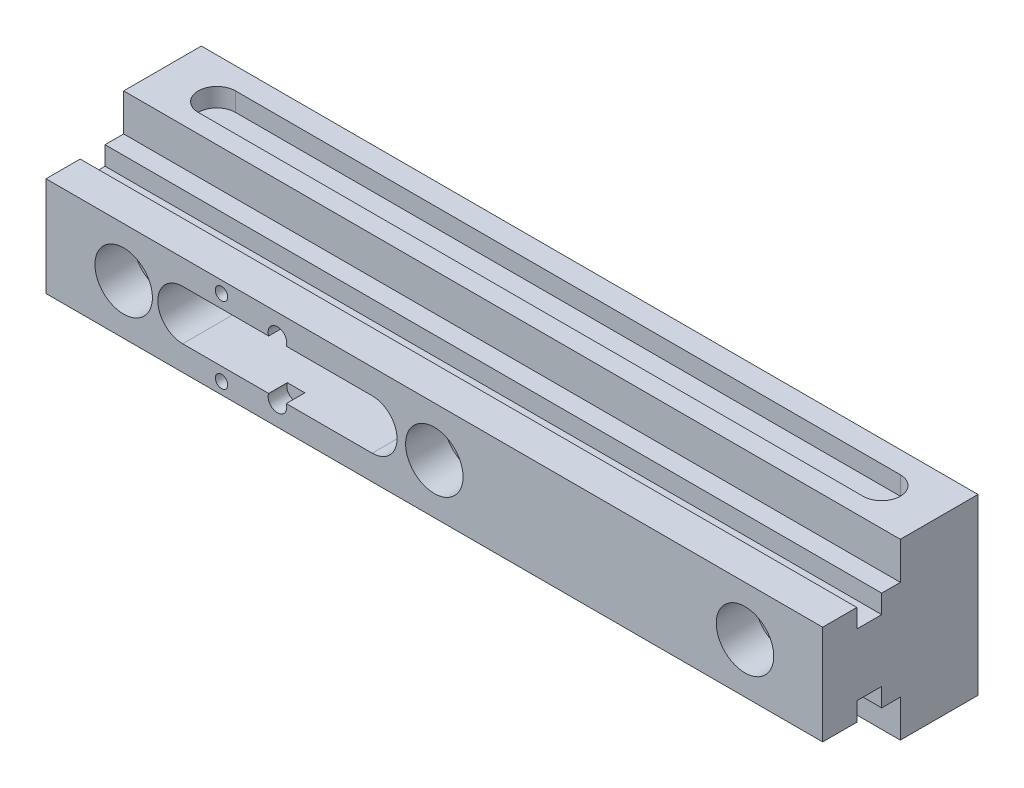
ISO-10303-21;
HEADER;
FILE_DESCRIPTION(('STEP AP214'),'2;1');
FILE_NAME('part.step','',(''),(''),'','','');
FILE_SCHEMA(('AUTOMOTIVE_DESIGN { 1 0 10303 214 1 1 1 1 }'));
ENDSEC;
DATA;
#1=APPLICATION_CONTEXT('core data for automotive mechanical design processes');
#2=APPLICATION_PROTOCOL_DEFINITION('international standard','automotive_design',2000,#1);
#3=PRODUCT_CONTEXT('',#1,'mechanical');
#4=PRODUCT('Part','Part','',(#3));
#5=PRODUCT_RELATED_PRODUCT_CATEGORY('part','',(#4));
#6=PRODUCT_DEFINITION_FORMATION('','',#4);
#7=PRODUCT_DEFINITION_CONTEXT('part definition',#1,'design');
#8=PRODUCT_DEFINITION('design','',#6,#7);
#9=PRODUCT_DEFINITION_SHAPE('','',#8);
#10=(LENGTH_UNIT() NAMED_UNIT(*) SI_UNIT(.MILLI.,.METRE.));
#11=(NAMED_UNIT(*) PLANE_ANGLE_UNIT() SI_UNIT($,.RADIAN.));
#12=(NAMED_UNIT(*) SI_UNIT($,.STERADIAN.) SOLID_ANGLE_UNIT());
#13=UNCERTAINTY_MEASURE_WITH_UNIT(LENGTH_MEASURE(1.E-05),#10,'distance_accuracy_value','');
#14=(GEOMETRIC_REPRESENTATION_CONTEXT(3) GLOBAL_UNCERTAINTY_ASSIGNED_CONTEXT((#13)) GLOBAL_UNIT_ASSIGNED_CONTEXT((#10,
#11,#12)) REPRESENTATION_CONTEXT('',''));
#15=CARTESIAN_POINT('',(0.,0.,0.));
#16=DIRECTION('',(0.,0.,1.));
#17=DIRECTION('',(1.,0.,0.));
#18=AXIS2_PLACEMENT_3D('',#15,#16,#17);
#19=CARTESIAN_POINT('',(0.,22.,13.));
#20=DIRECTION('',(0.,-1.,0.));
#21=DIRECTION('',(0.,0.,-1.));
#22=AXIS2_PLACEMENT_3D('',#19,#20,#21);
#23=PLANE('',#22);
#24=CARTESIAN_POINT('',(-107.,22.,13.));
#25=DIRECTION('',(0.,1.,0.));
#26=DIRECTION('',(0.,0.,1.));
#27=AXIS2_PLACEMENT_3D('',#24,#25,#26);
#28=CIRCLE('',#27,6.);
#29=CARTESIAN_POINT('',(-107.,22.,7.));
#30=VERTEX_POINT('',#29);
#31=CARTESIAN_POINT('',(-107.,22.,19.));
#32=VERTEX_POINT('',#31);
#33=EDGE_CURVE('E440',#30,#32,#28,.T.);
#34=ORIENTED_EDGE('',*,*,#33,.T.);
#35=DIRECTION('',(1.,0.,0.));
#36=VECTOR('',#35,1.);
#37=CARTESIAN_POINT('',(-107.,22.,19.));
#38=LINE('',#37,#36);
#39=CARTESIAN_POINT('',(107.,22.,19.));
#40=VERTEX_POINT('',#39);
#41=EDGE_CURVE('E436',#40,#32,#38,.F.);
#42=ORIENTED_EDGE('',*,*,#41,.F.);
#43=CARTESIAN_POINT('',(107.,22.,13.));
#44=DIRECTION('',(0.,1.,0.));
#45=DIRECTION('',(0.,0.,1.));
#46=AXIS2_PLACEMENT_3D('',#43,#44,#45);
#47=CIRCLE('',#46,6.);
#48=CARTESIAN_POINT('',(107.,22.,7.));
#49=VERTEX_POINT('',#48);
#50=EDGE_CURVE('E429',#40,#49,#47,.T.);
#51=ORIENTED_EDGE('',*,*,#50,.T.);
#52=DIRECTION('',(1.,0.,0.));
#53=VECTOR('',#52,1.);
#54=CARTESIAN_POINT('',(107.,22.,7.));
#55=LINE('',#54,#53);
#56=EDGE_CURVE('E257',#30,#49,#55,.T.);
#57=ORIENTED_EDGE('',*,*,#56,.F.);
#58=EDGE_LOOP('',(#34,#42,#51,#57));
#59=FACE_BOUND('',#58,.T.);
#60=ADVANCED_FACE('F14',(#59),#23,.F.);
#61=CARTESIAN_POINT('',(0.,-22.,13.));
#62=DIRECTION('',(0.,-1.,0.));
#63=DIRECTION('',(0.,0.,-1.));
#64=AXIS2_PLACEMENT_3D('',#61,#62,#63);
#65=PLANE('',#64);
#66=DIRECTION('',(-1.,0.,0.));
#67=VECTOR('',#66,1.);
#68=CARTESIAN_POINT('',(-107.,-22.,19.));
#69=LINE('',#68,#67);
#70=CARTESIAN_POINT('',(107.,-22.,19.));
#71=VERTEX_POINT('',#70);
#72=CARTESIAN_POINT('',(-107.,-22.,19.));
#73=VERTEX_POINT('',#72);
#74=EDGE_CURVE('E396',#71,#73,#69,.T.);
#75=ORIENTED_EDGE('',*,*,#74,.T.);
#76=CARTESIAN_POINT('',(-107.,-22.,13.));
#77=DIRECTION('',(0.,1.,0.));
#78=DIRECTION('',(0.,0.,1.));
#79=AXIS2_PLACEMENT_3D('',#76,#77,#78);
#80=CIRCLE('',#79,6.);
#81=CARTESIAN_POINT('',(-107.,-22.,7.));
#82=VERTEX_POINT('',#81);
#83=EDGE_CURVE('E402',#73,#82,#80,.F.);
#84=ORIENTED_EDGE('',*,*,#83,.T.);
#85=DIRECTION('',(1.,0.,0.));
#86=VECTOR('',#85,1.);
#87=CARTESIAN_POINT('',(107.,-22.,7.));
#88=LINE('',#87,#86);
#89=CARTESIAN_POINT('',(107.,-22.,7.));
#90=VERTEX_POINT('',#89);
#91=EDGE_CURVE('E405',#82,#90,#88,.T.);
#92=ORIENTED_EDGE('',*,*,#91,.T.);
#93=CARTESIAN_POINT('',(107.,-22.,13.));
#94=DIRECTION('',(0.,1.,0.));
#95=DIRECTION('',(0.,0.,1.));
#96=AXIS2_PLACEMENT_3D('',#93,#94,#95);
#97=CIRCLE('',#96,6.);
#98=EDGE_CURVE('E408',#90,#71,#97,.F.);
#99=ORIENTED_EDGE('',*,*,#98,.T.);
#100=EDGE_LOOP('',(#75,#84,#92,#99));
#101=FACE_BOUND('',#100,.T.);
#102=ADVANCED_FACE('F952',(#101),#65,.T.);
#103=CARTESIAN_POINT('',(-100.,0.,43.75));
#104=DIRECTION('',(0.,0.,1.));
#105=DIRECTION('',(0.,-1.,0.));
#106=AXIS2_PLACEMENT_3D('',#103,#104,#105);
#107=CYLINDRICAL_SURFACE('',#106,9.25);
#108=CARTESIAN_POINT('',(-100.,0.,50.));
#109=DIRECTION('',(0.,0.,1.));
#110=DIRECTION('',(0.,-1.,0.));
#111=AXIS2_PLACEMENT_3D('',#108,#109,#110);
#112=CIRCLE('',#111,9.25);
#113=CARTESIAN_POINT('',(-100.,-9.24999999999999,50.));
#114=VERTEX_POINT('',#113);
#115=EDGE_CURVE('E475',#114,#114,#112,.F.);
#116=ORIENTED_EDGE('',*,*,#115,.F.);
#117=EDGE_LOOP('',(#116));
#118=FACE_BOUND('',#117,.T.);
#119=CARTESIAN_POINT('',(-100.,0.,37.5));
#120=DIRECTION('',(0.,0.,1.));
#121=DIRECTION('',(0.,-1.,0.));
#122=AXIS2_PLACEMENT_3D('',#119,#120,#121);
#123=CIRCLE('',#122,9.25);
#124=CARTESIAN_POINT('',(-100.,-9.24999999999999,37.5));
#125=VERTEX_POINT('',#124);
#126=EDGE_CURVE('E392',#125,#125,#123,.T.);
#127=ORIENTED_EDGE('',*,*,#126,.F.);
#128=EDGE_LOOP('',(#127));
#129=FACE_BOUND('',#128,.T.);
#130=ADVANCED_FACE('F942',(#118,#129),#107,.F.);
#131=CARTESIAN_POINT('',(100.,0.,43.75));
#132=DIRECTION('',(0.,0.,1.));
#133=DIRECTION('',(0.,-1.,0.));
#134=AXIS2_PLACEMENT_3D('',#131,#132,#133);
#135=CYLINDRICAL_SURFACE('',#134,9.25);
#136=CARTESIAN_POINT('',(100.,0.,50.));
#137=DIRECTION('',(0.,0.,1.));
#138=DIRECTION('',(0.,-1.,0.));
#139=AXIS2_PLACEMENT_3D('',#136,#137,#138);
#140=CIRCLE('',#139,9.25);
#141=CARTESIAN_POINT('',(100.,-9.24999999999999,50.));
#142=VERTEX_POINT('',#141);
#143=EDGE_CURVE('E472',#142,#142,#140,.F.);
#144=ORIENTED_EDGE('',*,*,#143,.F.);
#145=EDGE_LOOP('',(#144));
#146=FACE_BOUND('',#145,.T.);
#147=CARTESIAN_POINT('',(100.,0.,37.5));
#148=DIRECTION('',(0.,0.,1.));
#149=DIRECTION('',(0.,-1.,0.));
#150=AXIS2_PLACEMENT_3D('',#147,#148,#149);
#151=CIRCLE('',#150,9.25);
#152=CARTESIAN_POINT('',(100.,-9.24999999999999,37.5));
#153=VERTEX_POINT('',#152);
#154=EDGE_CURVE('E395',#153,#153,#151,.T.);
#155=ORIENTED_EDGE('',*,*,#154,.F.);
#156=EDGE_LOOP('',(#155));
#157=FACE_BOUND('',#156,.T.);
#158=ADVANCED_FACE('F932',(#146,#157),#135,.F.);
#159=CARTESIAN_POINT('',(0.,0.,43.75));
#160=DIRECTION('',(0.,0.,1.));
#161=DIRECTION('',(0.,-1.,0.));
#162=AXIS2_PLACEMENT_3D('',#159,#160,#161);
#163=CYLINDRICAL_SURFACE('',#162,9.25);
#164=CARTESIAN_POINT('',(0.,0.,37.5));
#165=DIRECTION('',(0.,0.,1.));
#166=DIRECTION('',(0.,-1.,0.));
#167=AXIS2_PLACEMENT_3D('',#164,#165,#166);
#168=CIRCLE('',#167,9.25);
#169=CARTESIAN_POINT('',(0.,-9.25,37.5));
#170=VERTEX_POINT('',#169);
#171=EDGE_CURVE('E386',#170,#170,#168,.T.);
#172=ORIENTED_EDGE('',*,*,#171,.F.);
#173=EDGE_LOOP('',(#172));
#174=FACE_BOUND('',#173,.T.);
#175=CARTESIAN_POINT('',(0.,0.,50.));
#176=DIRECTION('',(0.,0.,1.));
#177=DIRECTION('',(0.,-1.,0.));
#178=AXIS2_PLACEMENT_3D('',#175,#176,#177);
#179=CIRCLE('',#178,9.25);
#180=CARTESIAN_POINT('',(0.,-9.25,50.));
#181=VERTEX_POINT('',#180);
#182=EDGE_CURVE('E389',#181,#181,#179,.F.);
#183=ORIENTED_EDGE('',*,*,#182,.F.);
#184=EDGE_LOOP('',(#183));
#185=FACE_BOUND('',#184,.T.);
#186=ADVANCED_FACE('F922',(#174,#185),#163,.F.);
#187=CARTESIAN_POINT('',(107.,28.,7.));
#188=DIRECTION('',(0.,0.,1.));
#189=DIRECTION('',(0.,-1.,0.));
#190=AXIS2_PLACEMENT_3D('',#187,#188,#189);
#191=PLANE('',#190);
#192=ORIENTED_EDGE('',*,*,#56,.T.);
#193=DIRECTION('',(0.,1.,0.));
#194=VECTOR('',#193,1.);
#195=CARTESIAN_POINT('',(107.,28.,7.));
#196=LINE('',#195,#194);
#197=CARTESIAN_POINT('',(107.,28.,7.));
#198=VERTEX_POINT('',#197);
#199=EDGE_CURVE('E427',#49,#198,#196,.T.);
#200=ORIENTED_EDGE('',*,*,#199,.T.);
#201=DIRECTION('',(1.,0.,0.));
#202=VECTOR('',#201,1.);
#203=CARTESIAN_POINT('',(-125.,28.,7.));
#204=LINE('',#203,#202);
#205=CARTESIAN_POINT('',(-107.,28.,7.));
#206=VERTEX_POINT('',#205);
#207=EDGE_CURVE('E341',#198,#206,#204,.F.);
#208=ORIENTED_EDGE('',*,*,#207,.T.);
#209=DIRECTION('',(0.,1.,0.));
#210=VECTOR('',#209,1.);
#211=CARTESIAN_POINT('',(-107.,28.,7.));
#212=LINE('',#211,#210);
#213=EDGE_CURVE('E437',#206,#30,#212,.F.);
#214=ORIENTED_EDGE('',*,*,#213,.T.);
#215=EDGE_LOOP('',(#192,#200,#208,#214));
#216=FACE_BOUND('',#215,.T.);
#217=ADVANCED_FACE('F912',(#216),#191,.T.);
#218=CARTESIAN_POINT('',(-107.,28.,13.));
#219=DIRECTION('',(0.,1.,0.));
#220=DIRECTION('',(0.,0.,1.));
#221=AXIS2_PLACEMENT_3D('',#218,#219,#220);
#222=CYLINDRICAL_SURFACE('',#221,6.);
#223=DIRECTION('',(0.,1.,0.));
#224=VECTOR('',#223,1.);
#225=CARTESIAN_POINT('',(-107.,28.,19.));
#226=LINE('',#225,#224);
#227=CARTESIAN_POINT('',(-107.,28.,19.));
#228=VERTEX_POINT('',#227);
#229=EDGE_CURVE('E433',#32,#228,#226,.T.);
#230=ORIENTED_EDGE('',*,*,#229,.F.);
#231=ORIENTED_EDGE('',*,*,#33,.F.);
#232=ORIENTED_EDGE('',*,*,#213,.F.);
#233=CARTESIAN_POINT('',(-107.,28.,13.));
#234=DIRECTION('',(0.,1.,0.));
#235=DIRECTION('',(0.,0.,1.));
#236=AXIS2_PLACEMENT_3D('',#233,#234,#235);
#237=CIRCLE('',#236,6.);
#238=EDGE_CURVE('E340',#206,#228,#237,.T.);
#239=ORIENTED_EDGE('',*,*,#238,.T.);
#240=EDGE_LOOP('',(#230,#231,#232,#239));
#241=FACE_BOUND('',#240,.T.);
#242=ADVANCED_FACE('F902',(#241),#222,.F.);
#243=CARTESIAN_POINT('',(-107.,28.,19.));
#244=DIRECTION('',(0.,0.,-1.));
#245=DIRECTION('',(0.,1.,0.));
#246=AXIS2_PLACEMENT_3D('',#243,#244,#245);
#247=PLANE('',#246);
#248=ORIENTED_EDGE('',*,*,#41,.T.);
#249=ORIENTED_EDGE('',*,*,#229,.T.);
#250=DIRECTION('',(1.,0.,0.));
#251=VECTOR('',#250,1.);
#252=CARTESIAN_POINT('',(-125.,28.,19.));
#253=LINE('',#252,#251);
#254=CARTESIAN_POINT('',(107.,28.,19.));
#255=VERTEX_POINT('',#254);
#256=EDGE_CURVE('E338',#228,#255,#253,.T.);
#257=ORIENTED_EDGE('',*,*,#256,.T.);
#258=DIRECTION('',(0.,1.,0.));
#259=VECTOR('',#258,1.);
#260=CARTESIAN_POINT('',(107.,28.,19.));
#261=LINE('',#260,#259);
#262=EDGE_CURVE('E430',#255,#40,#261,.F.);
#263=ORIENTED_EDGE('',*,*,#262,.T.);
#264=EDGE_LOOP('',(#248,#249,#257,#263));
#265=FACE_BOUND('',#264,.T.);
#266=ADVANCED_FACE('F892',(#265),#247,.T.);
#267=CARTESIAN_POINT('',(107.,28.,13.));
#268=DIRECTION('',(0.,1.,0.));
#269=DIRECTION('',(0.,0.,1.));
#270=AXIS2_PLACEMENT_3D('',#267,#268,#269);
#271=CYLINDRICAL_SURFACE('',#270,6.);
#272=ORIENTED_EDGE('',*,*,#199,.F.);
#273=ORIENTED_EDGE('',*,*,#50,.F.);
#274=ORIENTED_EDGE('',*,*,#262,.F.);
#275=CARTESIAN_POINT('',(107.,28.,13.));
#276=DIRECTION('',(0.,1.,0.));
#277=DIRECTION('',(0.,0.,1.));
#278=AXIS2_PLACEMENT_3D('',#275,#276,#277);
#279=CIRCLE('',#278,6.);
#280=EDGE_CURVE('E337',#255,#198,#279,.T.);
#281=ORIENTED_EDGE('',*,*,#280,.T.);
#282=EDGE_LOOP('',(#272,#273,#274,#281));
#283=FACE_BOUND('',#282,.T.);
#284=ADVANCED_FACE('F883',(#283),#271,.F.);
#285=CARTESIAN_POINT('',(-125.,16.,25.));
#286=DIRECTION('',(0.,0.,-1.));
#287=DIRECTION('',(0.,1.,0.));
#288=AXIS2_PLACEMENT_3D('',#285,#286,#287);
#289=PLANE('',#288);
#290=DIRECTION('',(1.,0.,0.));
#291=VECTOR('',#290,1.);
#292=CARTESIAN_POINT('',(-125.,16.,25.));
#293=LINE('',#292,#291);
#294=CARTESIAN_POINT('',(-125.,16.,25.));
#295=VERTEX_POINT('',#294);
#296=CARTESIAN_POINT('',(125.,16.,25.));
#297=VERTEX_POINT('',#296);
#298=EDGE_CURVE('E425',#295,#297,#293,.T.);
#299=ORIENTED_EDGE('',*,*,#298,.T.);
#300=DIRECTION('',(0.,-1.,0.));
#301=VECTOR('',#300,1.);
#302=CARTESIAN_POINT('',(125.,-11.8571428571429,25.));
#303=LINE('',#302,#301);
#304=CARTESIAN_POINT('',(125.,28.,25.));
#305=VERTEX_POINT('',#304);
#306=EDGE_CURVE('E331',#305,#297,#303,.T.);
#307=ORIENTED_EDGE('',*,*,#306,.F.);
#308=DIRECTION('',(1.,0.,0.));
#309=VECTOR('',#308,1.);
#310=CARTESIAN_POINT('',(-125.,28.,25.));
#311=LINE('',#310,#309);
#312=CARTESIAN_POINT('',(-125.,28.,25.));
#313=VERTEX_POINT('',#312);
#314=EDGE_CURVE('E345',#305,#313,#311,.F.);
#315=ORIENTED_EDGE('',*,*,#314,.T.);
#316=DIRECTION('',(0.,-1.,0.));
#317=VECTOR('',#316,1.);
#318=CARTESIAN_POINT('',(-125.,-11.8571428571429,25.));
#319=LINE('',#318,#317);
#320=EDGE_CURVE('E347',#295,#313,#319,.F.);
#321=ORIENTED_EDGE('',*,*,#320,.F.);
#322=EDGE_LOOP('',(#299,#307,#315,#321));
#323=FACE_BOUND('',#322,.T.);
#324=ADVANCED_FACE('F617',(#323),#289,.F.);
#325=CARTESIAN_POINT('',(-125.,16.,31.));
#326=DIRECTION('',(0.,-1.,0.));
#327=DIRECTION('',(0.,0.,-1.));
#328=AXIS2_PLACEMENT_3D('',#325,#326,#327);
#329=PLANE('',#328);
#330=DIRECTION('',(1.,0.,0.));
#331=VECTOR('',#330,1.);
#332=CARTESIAN_POINT('',(-125.,16.,31.));
#333=LINE('',#332,#331);
#334=CARTESIAN_POINT('',(-125.,16.,31.));
#335=VERTEX_POINT('',#334);
#336=CARTESIAN_POINT('',(125.,16.,31.));
#337=VERTEX_POINT('',#336);
#338=EDGE_CURVE('E423',#335,#337,#333,.T.);
#339=ORIENTED_EDGE('',*,*,#338,.T.);
#340=DIRECTION('',(0.,0.,1.));
#341=VECTOR('',#340,1.);
#342=CARTESIAN_POINT('',(125.,16.,23.9285714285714));
#343=LINE('',#342,#341);
#344=EDGE_CURVE('E328',#297,#337,#343,.T.);
#345=ORIENTED_EDGE('',*,*,#344,.F.);
#346=ORIENTED_EDGE('',*,*,#298,.F.);
#347=DIRECTION('',(0.,0.,-1.));
#348=VECTOR('',#347,1.);
#349=CARTESIAN_POINT('',(-125.,16.,23.9285714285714));
#350=LINE('',#349,#348);
#351=EDGE_CURVE('E350',#335,#295,#350,.T.);
#352=ORIENTED_EDGE('',*,*,#351,.F.);
#353=EDGE_LOOP('',(#339,#345,#346,#352));
#354=FACE_BOUND('',#353,.T.);
#355=ADVANCED_FACE('F621',(#354),#329,.F.);
#356=CARTESIAN_POINT('',(-125.,10.,31.));
#357=DIRECTION('',(0.,0.,-1.));
#358=DIRECTION('',(0.,1.,0.));
#359=AXIS2_PLACEMENT_3D('',#356,#357,#358);
#360=PLANE('',#359);
#361=DIRECTION('',(1.,0.,0.));
#362=VECTOR('',#361,1.);
#363=CARTESIAN_POINT('',(-125.,10.,31.));
#364=LINE('',#363,#362);
#365=CARTESIAN_POINT('',(-125.,10.,31.));
#366=VERTEX_POINT('',#365);
#367=CARTESIAN_POINT('',(125.,10.,31.));
#368=VERTEX_POINT('',#367);
#369=EDGE_CURVE('E421',#366,#368,#364,.T.);
#370=ORIENTED_EDGE('',*,*,#369,.T.);
#371=DIRECTION('',(0.,-1.,0.));
#372=VECTOR('',#371,1.);
#373=CARTESIAN_POINT('',(125.,-11.8571428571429,31.));
#374=LINE('',#373,#372);
#375=EDGE_CURVE('E325',#337,#368,#374,.T.);
#376=ORIENTED_EDGE('',*,*,#375,.F.);
#377=ORIENTED_EDGE('',*,*,#338,.F.);
#378=DIRECTION('',(0.,-1.,0.));
#379=VECTOR('',#378,1.);
#380=CARTESIAN_POINT('',(-125.,-11.8571428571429,31.));
#381=LINE('',#380,#379);
#382=EDGE_CURVE('E353',#366,#335,#381,.F.);
#383=ORIENTED_EDGE('',*,*,#382,.F.);
#384=EDGE_LOOP('',(#370,#376,#377,#383));
#385=FACE_BOUND('',#384,.T.);
#386=ADVANCED_FACE('F623',(#385),#360,.F.);
#387=CARTESIAN_POINT('',(-125.,10.,39.));
#388=DIRECTION('',(0.,-1.,0.));
#389=DIRECTION('',(0.,0.,-1.));
#390=AXIS2_PLACEMENT_3D('',#387,#388,#389);
#391=PLANE('',#390);
#392=DIRECTION('',(1.,0.,0.));
#393=VECTOR('',#392,1.);
#394=CARTESIAN_POINT('',(-125.,10.,39.));
#395=LINE('',#394,#393);
#396=CARTESIAN_POINT('',(-125.,10.,39.));
#397=VERTEX_POINT('',#396);
#398=CARTESIAN_POINT('',(125.,10.,39.));
#399=VERTEX_POINT('',#398);
#400=EDGE_CURVE('E419',#397,#399,#395,.T.);
#401=ORIENTED_EDGE('',*,*,#400,.T.);
#402=DIRECTION('',(0.,0.,1.));
#403=VECTOR('',#402,1.);
#404=CARTESIAN_POINT('',(125.,10.,23.9285714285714));
#405=LINE('',#404,#403);
#406=EDGE_CURVE('E322',#368,#399,#405,.T.);
#407=ORIENTED_EDGE('',*,*,#406,.F.);
#408=ORIENTED_EDGE('',*,*,#369,.F.);
#409=DIRECTION('',(0.,0.,-1.));
#410=VECTOR('',#409,1.);
#411=CARTESIAN_POINT('',(-125.,10.,23.9285714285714));
#412=LINE('',#411,#410);
#413=EDGE_CURVE('E356',#397,#366,#412,.T.);
#414=ORIENTED_EDGE('',*,*,#413,.F.);
#415=EDGE_LOOP('',(#401,#407,#408,#414));
#416=FACE_BOUND('',#415,.T.);
#417=ADVANCED_FACE('F561',(#416),#391,.F.);
#418=CARTESIAN_POINT('',(-125.,16.,39.));
#419=DIRECTION('',(0.,0.,1.));
#420=DIRECTION('',(0.,-1.,0.));
#421=AXIS2_PLACEMENT_3D('',#418,#419,#420);
#422=PLANE('',#421);
#423=CARTESIAN_POINT('',(-68.5,12.25,39.));
#424=DIRECTION('',(0.,0.,1.));
#425=DIRECTION('',(0.,-1.,0.));
#426=AXIS2_PLACEMENT_3D('',#423,#424,#425);
#427=CIRCLE('',#426,2.);
#428=CARTESIAN_POINT('',(-68.5,10.25,39.));
#429=VERTEX_POINT('',#428);
#430=EDGE_CURVE('E229',#429,#429,#427,.T.);
#431=ORIENTED_EDGE('',*,*,#430,.T.);
#432=EDGE_LOOP('',(#431));
#433=FACE_BOUND('',#432,.T.);
#434=DIRECTION('',(1.,0.,0.));
#435=VECTOR('',#434,1.);
#436=CARTESIAN_POINT('',(-125.,16.,39.));
#437=LINE('',#436,#435);
#438=CARTESIAN_POINT('',(-125.,16.,39.));
#439=VERTEX_POINT('',#438);
#440=CARTESIAN_POINT('',(125.,16.,39.));
#441=VERTEX_POINT('',#440);
#442=EDGE_CURVE('E417',#439,#441,#437,.T.);
#443=ORIENTED_EDGE('',*,*,#442,.T.);
#444=DIRECTION('',(0.,-1.,0.));
#445=VECTOR('',#444,1.);
#446=CARTESIAN_POINT('',(125.,-11.8571428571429,39.));
#447=LINE('',#446,#445);
#448=EDGE_CURVE('E319',#399,#441,#447,.F.);
#449=ORIENTED_EDGE('',*,*,#448,.F.);
#450=ORIENTED_EDGE('',*,*,#400,.F.);
#451=DIRECTION('',(0.,-1.,0.));
#452=VECTOR('',#451,1.);
#453=CARTESIAN_POINT('',(-125.,-11.8571428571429,39.));
#454=LINE('',#453,#452);
#455=EDGE_CURVE('E359',#439,#397,#454,.T.);
#456=ORIENTED_EDGE('',*,*,#455,.F.);
#457=EDGE_LOOP('',(#443,#449,#450,#456));
#458=FACE_BOUND('',#457,.T.);
#459=ADVANCED_FACE('F557',(#433,#458),#422,.F.);
#460=CARTESIAN_POINT('',(-125.,16.,50.));
#461=DIRECTION('',(0.,-1.,0.));
#462=DIRECTION('',(0.,0.,-1.));
#463=AXIS2_PLACEMENT_3D('',#460,#461,#462);
#464=PLANE('',#463);
#465=DIRECTION('',(1.,0.,0.));
#466=VECTOR('',#465,1.);
#467=CARTESIAN_POINT('',(-125.,16.,50.));
#468=LINE('',#467,#466);
#469=CARTESIAN_POINT('',(125.,16.,50.));
#470=VERTEX_POINT('',#469);
#471=CARTESIAN_POINT('',(-125.,16.,50.));
#472=VERTEX_POINT('',#471);
#473=EDGE_CURVE('E387',#470,#472,#468,.F.);
#474=ORIENTED_EDGE('',*,*,#473,.F.);
#475=DIRECTION('',(0.,0.,1.));
#476=VECTOR('',#475,1.);
#477=CARTESIAN_POINT('',(125.,16.,23.9285714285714));
#478=LINE('',#477,#476);
#479=EDGE_CURVE('E316',#441,#470,#478,.T.);
#480=ORIENTED_EDGE('',*,*,#479,.F.);
#481=ORIENTED_EDGE('',*,*,#442,.F.);
#482=DIRECTION('',(0.,0.,-1.));
#483=VECTOR('',#482,1.);
#484=CARTESIAN_POINT('',(-125.,16.,23.9285714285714));
#485=LINE('',#484,#483);
#486=EDGE_CURVE('E362',#472,#439,#485,.T.);
#487=ORIENTED_EDGE('',*,*,#486,.F.);
#488=EDGE_LOOP('',(#474,#480,#481,#487));
#489=FACE_BOUND('',#488,.T.);
#490=ADVANCED_FACE('F560',(#489),#464,.F.);
#491=CARTESIAN_POINT('',(-125.,-16.,50.));
#492=DIRECTION('',(0.,-1.,0.));
#493=DIRECTION('',(0.,0.,-1.));
#494=AXIS2_PLACEMENT_3D('',#491,#492,#493);
#495=PLANE('',#494);
#496=DIRECTION('',(0.,0.,1.));
#497=VECTOR('',#496,1.);
#498=CARTESIAN_POINT('',(125.,-16.,23.9285714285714));
#499=LINE('',#498,#497);
#500=CARTESIAN_POINT('',(125.,-16.,50.));
#501=VERTEX_POINT('',#500);
#502=CARTESIAN_POINT('',(125.,-16.,39.));
#503=VERTEX_POINT('',#502);
#504=EDGE_CURVE('E310',#501,#503,#499,.F.);
#505=ORIENTED_EDGE('',*,*,#504,.F.);
#506=DIRECTION('',(1.,0.,0.));
#507=VECTOR('',#506,1.);
#508=CARTESIAN_POINT('',(-125.,-16.,50.));
#509=LINE('',#508,#507);
#510=CARTESIAN_POINT('',(-125.,-16.,50.));
#511=VERTEX_POINT('',#510);
#512=EDGE_CURVE('E390',#511,#501,#509,.T.);
#513=ORIENTED_EDGE('',*,*,#512,.F.);
#514=DIRECTION('',(0.,0.,-1.));
#515=VECTOR('',#514,1.);
#516=CARTESIAN_POINT('',(-125.,-16.,23.9285714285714));
#517=LINE('',#516,#515);
#518=CARTESIAN_POINT('',(-125.,-16.,39.));
#519=VERTEX_POINT('',#518);
#520=EDGE_CURVE('E368',#519,#511,#517,.F.);
#521=ORIENTED_EDGE('',*,*,#520,.F.);
#522=DIRECTION('',(1.,0.,0.));
#523=VECTOR('',#522,1.);
#524=CARTESIAN_POINT('',(-125.,-16.,39.));
#525=LINE('',#524,#523);
#526=EDGE_CURVE('E415',#503,#519,#525,.F.);
#527=ORIENTED_EDGE('',*,*,#526,.F.);
#528=EDGE_LOOP('',(#505,#513,#521,#527));
#529=FACE_BOUND('',#528,.T.);
#530=ADVANCED_FACE('F584',(#529),#495,.T.);
#531=CARTESIAN_POINT('',(-125.,-16.,39.));
#532=DIRECTION('',(0.,0.,-1.));
#533=DIRECTION('',(0.,1.,0.));
#534=AXIS2_PLACEMENT_3D('',#531,#532,#533);
#535=PLANE('',#534);
#536=CARTESIAN_POINT('',(-68.5,-12.25,39.));
#537=DIRECTION('',(0.,0.,-1.));
#538=DIRECTION('',(-1.,0.,0.));
#539=AXIS2_PLACEMENT_3D('',#536,#537,#538);
#540=CIRCLE('',#539,2.);
#541=CARTESIAN_POINT('',(-70.5,-12.25,39.));
#542=VERTEX_POINT('',#541);
#543=EDGE_CURVE('E534',#542,#542,#540,.T.);
#544=ORIENTED_EDGE('',*,*,#543,.F.);
#545=EDGE_LOOP('',(#544));
#546=FACE_BOUND('',#545,.T.);
#547=DIRECTION('',(0.,-1.,0.));
#548=VECTOR('',#547,1.);
#549=CARTESIAN_POINT('',(125.,-11.8571428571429,39.));
#550=LINE('',#549,#548);
#551=CARTESIAN_POINT('',(125.,-10.,39.));
#552=VERTEX_POINT('',#551);
#553=EDGE_CURVE('E307',#503,#552,#550,.F.);
#554=ORIENTED_EDGE('',*,*,#553,.F.);
#555=ORIENTED_EDGE('',*,*,#526,.T.);
#556=DIRECTION('',(0.,-1.,0.));
#557=VECTOR('',#556,1.);
#558=CARTESIAN_POINT('',(-125.,-11.8571428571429,39.));
#559=LINE('',#558,#557);
#560=CARTESIAN_POINT('',(-125.,-10.,39.));
#561=VERTEX_POINT('',#560);
#562=EDGE_CURVE('E371',#561,#519,#559,.T.);
#563=ORIENTED_EDGE('',*,*,#562,.F.);
#564=DIRECTION('',(1.,0.,0.));
#565=VECTOR('',#564,1.);
#566=CARTESIAN_POINT('',(-125.,-10.,39.));
#567=LINE('',#566,#565);
#568=EDGE_CURVE('E413',#552,#561,#567,.F.);
#569=ORIENTED_EDGE('',*,*,#568,.F.);
#570=EDGE_LOOP('',(#554,#555,#563,#569));
#571=FACE_BOUND('',#570,.T.);
#572=ADVANCED_FACE('F587',(#546,#571),#535,.T.);
#573=CARTESIAN_POINT('',(-125.,-10.,39.));
#574=DIRECTION('',(0.,-1.,0.));
#575=DIRECTION('',(0.,0.,-1.));
#576=AXIS2_PLACEMENT_3D('',#573,#574,#575);
#577=PLANE('',#576);
#578=DIRECTION('',(0.,0.,1.));
#579=VECTOR('',#578,1.);
#580=CARTESIAN_POINT('',(125.,-10.,23.9285714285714));
#581=LINE('',#580,#579);
#582=CARTESIAN_POINT('',(125.,-10.,31.));
#583=VERTEX_POINT('',#582);
#584=EDGE_CURVE('E304',#552,#583,#581,.F.);
#585=ORIENTED_EDGE('',*,*,#584,.F.);
#586=ORIENTED_EDGE('',*,*,#568,.T.);
#587=DIRECTION('',(0.,0.,-1.));
#588=VECTOR('',#587,1.);
#589=CARTESIAN_POINT('',(-125.,-10.,23.9285714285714));
#590=LINE('',#589,#588);
#591=CARTESIAN_POINT('',(-125.,-10.,31.));
#592=VERTEX_POINT('',#591);
#593=EDGE_CURVE('E374',#592,#561,#590,.F.);
#594=ORIENTED_EDGE('',*,*,#593,.F.);
#595=DIRECTION('',(1.,0.,0.));
#596=VECTOR('',#595,1.);
#597=CARTESIAN_POINT('',(-125.,-10.,31.));
#598=LINE('',#597,#596);
#599=EDGE_CURVE('E411',#583,#592,#598,.F.);
#600=ORIENTED_EDGE('',*,*,#599,.F.);
#601=EDGE_LOOP('',(#585,#586,#594,#600));
#602=FACE_BOUND('',#601,.T.);
#603=ADVANCED_FACE('F591',(#602),#577,.T.);
#604=CARTESIAN_POINT('',(-125.,-10.,31.));
#605=DIRECTION('',(0.,0.,1.));
#606=DIRECTION('',(0.,-1.,0.));
#607=AXIS2_PLACEMENT_3D('',#604,#605,#606);
#608=PLANE('',#607);
#609=DIRECTION('',(0.,-1.,0.));
#610=VECTOR('',#609,1.);
#611=CARTESIAN_POINT('',(125.,-11.8571428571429,31.));
#612=LINE('',#611,#610);
#613=CARTESIAN_POINT('',(125.,-16.,31.));
#614=VERTEX_POINT('',#613);
#615=EDGE_CURVE('E301',#583,#614,#612,.T.);
#616=ORIENTED_EDGE('',*,*,#615,.F.);
#617=ORIENTED_EDGE('',*,*,#599,.T.);
#618=DIRECTION('',(0.,-1.,0.));
#619=VECTOR('',#618,1.);
#620=CARTESIAN_POINT('',(-125.,-11.8571428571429,31.));
#621=LINE('',#620,#619);
#622=CARTESIAN_POINT('',(-125.,-16.,31.));
#623=VERTEX_POINT('',#622);
#624=EDGE_CURVE('E377',#623,#592,#621,.F.);
#625=ORIENTED_EDGE('',*,*,#624,.F.);
#626=DIRECTION('',(1.,0.,0.));
#627=VECTOR('',#626,1.);
#628=CARTESIAN_POINT('',(-125.,-16.,31.));
#629=LINE('',#628,#627);
#630=EDGE_CURVE('E409',#614,#623,#629,.F.);
#631=ORIENTED_EDGE('',*,*,#630,.F.);
#632=EDGE_LOOP('',(#616,#617,#625,#631));
#633=FACE_BOUND('',#632,.T.);
#634=ADVANCED_FACE('F595',(#633),#608,.T.);
#635=CARTESIAN_POINT('',(-125.,-16.,31.));
#636=DIRECTION('',(0.,-1.,0.));
#637=DIRECTION('',(0.,0.,-1.));
#638=AXIS2_PLACEMENT_3D('',#635,#636,#637);
#639=PLANE('',#638);
#640=DIRECTION('',(0.,0.,1.));
#641=VECTOR('',#640,1.);
#642=CARTESIAN_POINT('',(125.,-16.,23.9285714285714));
#643=LINE('',#642,#641);
#644=CARTESIAN_POINT('',(125.,-16.,25.));
#645=VERTEX_POINT('',#644);
#646=EDGE_CURVE('E298',#614,#645,#643,.F.);
#647=ORIENTED_EDGE('',*,*,#646,.F.);
#648=ORIENTED_EDGE('',*,*,#630,.T.);
#649=DIRECTION('',(0.,0.,-1.));
#650=VECTOR('',#649,1.);
#651=CARTESIAN_POINT('',(-125.,-16.,23.9285714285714));
#652=LINE('',#651,#650);
#653=CARTESIAN_POINT('',(-125.,-16.,25.));
#654=VERTEX_POINT('',#653);
#655=EDGE_CURVE('E380',#654,#623,#652,.F.);
#656=ORIENTED_EDGE('',*,*,#655,.F.);
#657=DIRECTION('',(1.,0.,0.));
#658=VECTOR('',#657,1.);
#659=CARTESIAN_POINT('',(-125.,-16.,25.));
#660=LINE('',#659,#658);
#661=EDGE_CURVE('E406',#645,#654,#660,.F.);
#662=ORIENTED_EDGE('',*,*,#661,.F.);
#663=EDGE_LOOP('',(#647,#648,#656,#662));
#664=FACE_BOUND('',#663,.T.);
#665=ADVANCED_FACE('F599',(#664),#639,.T.);
#666=CARTESIAN_POINT('',(-125.,-16.,25.));
#667=DIRECTION('',(0.,0.,1.));
#668=DIRECTION('',(0.,-1.,0.));
#669=AXIS2_PLACEMENT_3D('',#666,#667,#668);
#670=PLANE('',#669);
#671=DIRECTION('',(0.,-1.,0.));
#672=VECTOR('',#671,1.);
#673=CARTESIAN_POINT('',(125.,-11.8571428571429,25.));
#674=LINE('',#673,#672);
#675=CARTESIAN_POINT('',(125.,-28.,25.));
#676=VERTEX_POINT('',#675);
#677=EDGE_CURVE('E296',#645,#676,#674,.T.);
#678=ORIENTED_EDGE('',*,*,#677,.F.);
#679=ORIENTED_EDGE('',*,*,#661,.T.);
#680=DIRECTION('',(0.,-1.,0.));
#681=VECTOR('',#680,1.);
#682=CARTESIAN_POINT('',(-125.,-11.8571428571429,25.));
#683=LINE('',#682,#681);
#684=CARTESIAN_POINT('',(-125.,-28.,25.));
#685=VERTEX_POINT('',#684);
#686=EDGE_CURVE('E383',#685,#654,#683,.F.);
#687=ORIENTED_EDGE('',*,*,#686,.F.);
#688=DIRECTION('',(1.,0.,0.));
#689=VECTOR('',#688,1.);
#690=CARTESIAN_POINT('',(-125.,-28.,25.));
#691=LINE('',#690,#689);
#692=EDGE_CURVE('E287',#676,#685,#691,.F.);
#693=ORIENTED_EDGE('',*,*,#692,.F.);
#694=EDGE_LOOP('',(#678,#679,#687,#693));
#695=FACE_BOUND('',#694,.T.);
#696=ADVANCED_FACE('F603',(#695),#670,.T.);
#697=CARTESIAN_POINT('',(107.,-28.,13.));
#698=DIRECTION('',(0.,1.,0.));
#699=DIRECTION('',(0.,0.,1.));
#700=AXIS2_PLACEMENT_3D('',#697,#698,#699);
#701=CYLINDRICAL_SURFACE('',#700,6.);
#702=DIRECTION('',(0.,-1.,0.));
#703=VECTOR('',#702,1.);
#704=CARTESIAN_POINT('',(107.,-28.,19.));
#705=LINE('',#704,#703);
#706=CARTESIAN_POINT('',(107.,-28.,19.));
#707=VERTEX_POINT('',#706);
#708=EDGE_CURVE('E397',#707,#71,#705,.F.);
#709=ORIENTED_EDGE('',*,*,#708,.T.);
#710=ORIENTED_EDGE('',*,*,#98,.F.);
#711=DIRECTION('',(0.,-1.,0.));
#712=VECTOR('',#711,1.);
#713=CARTESIAN_POINT('',(107.,-28.,7.));
#714=LINE('',#713,#712);
#715=CARTESIAN_POINT('',(107.,-28.,7.));
#716=VERTEX_POINT('',#715);
#717=EDGE_CURVE('E403',#90,#716,#714,.T.);
#718=ORIENTED_EDGE('',*,*,#717,.T.);
#719=CARTESIAN_POINT('',(107.,-28.,13.));
#720=DIRECTION('',(0.,1.,0.));
#721=DIRECTION('',(0.,0.,1.));
#722=AXIS2_PLACEMENT_3D('',#719,#720,#721);
#723=CIRCLE('',#722,6.);
#724=EDGE_CURVE('E286',#707,#716,#723,.T.);
#725=ORIENTED_EDGE('',*,*,#724,.F.);
#726=EDGE_LOOP('',(#709,#710,#718,#725));
#727=FACE_BOUND('',#726,.T.);
#728=ADVANCED_FACE('F686',(#727),#701,.F.);
#729=CARTESIAN_POINT('',(107.,-28.,7.));
#730=DIRECTION('',(0.,0.,-1.));
#731=DIRECTION('',(1.,0.,0.));
#732=AXIS2_PLACEMENT_3D('',#729,#730,#731);
#733=PLANE('',#732);
#734=ORIENTED_EDGE('',*,*,#717,.F.);
#735=ORIENTED_EDGE('',*,*,#91,.F.);
#736=DIRECTION('',(0.,1.,0.));
#737=VECTOR('',#736,1.);
#738=CARTESIAN_POINT('',(-107.,-28.,7.));
#739=LINE('',#738,#737);
#740=CARTESIAN_POINT('',(-107.,-28.,7.));
#741=VERTEX_POINT('',#740);
#742=EDGE_CURVE('E400',#82,#741,#739,.F.);
#743=ORIENTED_EDGE('',*,*,#742,.T.);
#744=DIRECTION('',(1.,0.,0.));
#745=VECTOR('',#744,1.);
#746=CARTESIAN_POINT('',(-125.,-28.,7.));
#747=LINE('',#746,#745);
#748=EDGE_CURVE('E283',#716,#741,#747,.F.);
#749=ORIENTED_EDGE('',*,*,#748,.F.);
#750=EDGE_LOOP('',(#734,#735,#743,#749));
#751=FACE_BOUND('',#750,.T.);
#752=ADVANCED_FACE('F682',(#751),#733,.F.);
#753=CARTESIAN_POINT('',(-107.,-28.,13.));
#754=DIRECTION('',(0.,1.,0.));
#755=DIRECTION('',(0.,0.,1.));
#756=AXIS2_PLACEMENT_3D('',#753,#754,#755);
#757=CYLINDRICAL_SURFACE('',#756,6.);
#758=ORIENTED_EDGE('',*,*,#742,.F.);
#759=ORIENTED_EDGE('',*,*,#83,.F.);
#760=DIRECTION('',(0.,-1.,0.));
#761=VECTOR('',#760,1.);
#762=CARTESIAN_POINT('',(-107.,-28.,19.));
#763=LINE('',#762,#761);
#764=CARTESIAN_POINT('',(-107.,-28.,19.));
#765=VERTEX_POINT('',#764);
#766=EDGE_CURVE('E393',#73,#765,#763,.T.);
#767=ORIENTED_EDGE('',*,*,#766,.T.);
#768=CARTESIAN_POINT('',(-107.,-28.,13.));
#769=DIRECTION('',(0.,1.,0.));
#770=DIRECTION('',(0.,0.,1.));
#771=AXIS2_PLACEMENT_3D('',#768,#769,#770);
#772=CIRCLE('',#771,6.);
#773=EDGE_CURVE('E282',#741,#765,#772,.T.);
#774=ORIENTED_EDGE('',*,*,#773,.F.);
#775=EDGE_LOOP('',(#758,#759,#767,#774));
#776=FACE_BOUND('',#775,.T.);
#777=ADVANCED_FACE('F678',(#776),#757,.F.);
#778=CARTESIAN_POINT('',(-107.,-28.,19.));
#779=DIRECTION('',(0.,0.,1.));
#780=DIRECTION('',(-1.,0.,0.));
#781=AXIS2_PLACEMENT_3D('',#778,#779,#780);
#782=PLANE('',#781);
#783=ORIENTED_EDGE('',*,*,#766,.F.);
#784=ORIENTED_EDGE('',*,*,#74,.F.);
#785=ORIENTED_EDGE('',*,*,#708,.F.);
#786=DIRECTION('',(1.,0.,0.));
#787=VECTOR('',#786,1.);
#788=CARTESIAN_POINT('',(-125.,-28.,19.));
#789=LINE('',#788,#787);
#790=EDGE_CURVE('E278',#765,#707,#789,.T.);
#791=ORIENTED_EDGE('',*,*,#790,.F.);
#792=EDGE_LOOP('',(#783,#784,#785,#791));
#793=FACE_BOUND('',#792,.T.);
#794=ADVANCED_FACE('F674',(#793),#782,.F.);
#795=CARTESIAN_POINT('',(100.,0.,37.5));
#796=DIRECTION('',(0.,0.,1.));
#797=DIRECTION('',(0.,-1.,0.));
#798=AXIS2_PLACEMENT_3D('',#795,#796,#797);
#799=PLANE('',#798);
#800=CARTESIAN_POINT('',(100.,0.,37.5));
#801=DIRECTION('',(0.,0.,1.));
#802=DIRECTION('',(0.,-1.,0.));
#803=AXIS2_PLACEMENT_3D('',#800,#801,#802);
#804=CIRCLE('',#803,6.);
#805=CARTESIAN_POINT('',(100.,-5.99999999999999,37.5));
#806=VERTEX_POINT('',#805);
#807=EDGE_CURVE('E281',#806,#806,#804,.F.);
#808=ORIENTED_EDGE('',*,*,#807,.T.);
#809=EDGE_LOOP('',(#808));
#810=FACE_BOUND('',#809,.T.);
#811=ORIENTED_EDGE('',*,*,#154,.T.);
#812=EDGE_LOOP('',(#811));
#813=FACE_BOUND('',#812,.T.);
#814=ADVANCED_FACE('F670',(#810,#813),#799,.T.);
#815=CARTESIAN_POINT('',(-100.,0.,37.5));
#816=DIRECTION('',(0.,0.,1.));
#817=DIRECTION('',(0.,-1.,0.));
#818=AXIS2_PLACEMENT_3D('',#815,#816,#817);
#819=PLANE('',#818);
#820=CARTESIAN_POINT('',(-100.,0.,37.5));
#821=DIRECTION('',(0.,0.,1.));
#822=DIRECTION('',(0.,-1.,0.));
#823=AXIS2_PLACEMENT_3D('',#820,#821,#822);
#824=CIRCLE('',#823,6.);
#825=CARTESIAN_POINT('',(-100.,-5.99999999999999,37.5));
#826=VERTEX_POINT('',#825);
#827=EDGE_CURVE('E458',#826,#826,#824,.F.);
#828=ORIENTED_EDGE('',*,*,#827,.T.);
#829=EDGE_LOOP('',(#828));
#830=FACE_BOUND('',#829,.T.);
#831=ORIENTED_EDGE('',*,*,#126,.T.);
#832=EDGE_LOOP('',(#831));
#833=FACE_BOUND('',#832,.T.);
#834=ADVANCED_FACE('F546',(#830,#833),#819,.T.);
#835=CARTESIAN_POINT('',(-125.,0.,50.));
#836=DIRECTION('',(0.,0.,1.));
#837=DIRECTION('',(0.,-1.,0.));
#838=AXIS2_PLACEMENT_3D('',#835,#836,#837);
#839=PLANE('',#838);
#840=CARTESIAN_POINT('',(-68.5,-12.25,50.));
#841=DIRECTION('',(0.,0.,1.));
#842=DIRECTION('',(1.,0.,0.));
#843=AXIS2_PLACEMENT_3D('',#840,#841,#842);
#844=CIRCLE('',#843,2.);
#845=CARTESIAN_POINT('',(-66.5,-12.25,50.));
#846=VERTEX_POINT('',#845);
#847=EDGE_CURVE('E537',#846,#846,#844,.T.);
#848=ORIENTED_EDGE('',*,*,#847,.F.);
#849=EDGE_LOOP('',(#848));
#850=FACE_BOUND('',#849,.T.);
#851=CARTESIAN_POINT('',(-68.5,12.25,50.));
#852=DIRECTION('',(0.,0.,1.));
#853=DIRECTION('',(1.,0.,0.));
#854=AXIS2_PLACEMENT_3D('',#851,#852,#853);
#855=CIRCLE('',#854,2.);
#856=CARTESIAN_POINT('',(-66.5,12.25,50.));
#857=VERTEX_POINT('',#856);
#858=EDGE_CURVE('E531',#857,#857,#855,.T.);
#859=ORIENTED_EDGE('',*,*,#858,.F.);
#860=EDGE_LOOP('',(#859));
#861=FACE_BOUND('',#860,.T.);
#862=CARTESIAN_POINT('',(-50.5,-9.,50.));
#863=DIRECTION('',(0.,0.,1.));
#864=DIRECTION('',(1.,0.,0.));
#865=AXIS2_PLACEMENT_3D('',#862,#863,#864);
#866=CIRCLE('',#865,3.);
#867=CARTESIAN_POINT('',(-53.3284271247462,-8.,50.));
#868=VERTEX_POINT('',#867);
#869=CARTESIAN_POINT('',(-47.6715728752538,-8.,50.));
#870=VERTEX_POINT('',#869);
#871=EDGE_CURVE('E221',#868,#870,#866,.T.);
#872=ORIENTED_EDGE('',*,*,#871,.F.);
#873=DIRECTION('',(1.,0.,0.));
#874=VECTOR('',#873,1.);
#875=CARTESIAN_POINT('',(-81.,-8.,50.));
#876=LINE('',#875,#874);
#877=CARTESIAN_POINT('',(-81.,-8.,50.));
#878=VERTEX_POINT('',#877);
#879=EDGE_CURVE('E242',#878,#868,#876,.T.);
#880=ORIENTED_EDGE('',*,*,#879,.F.);
#881=CARTESIAN_POINT('',(-81.,0.,50.));
#882=DIRECTION('',(0.,0.,1.));
#883=DIRECTION('',(0.,-1.,0.));
#884=AXIS2_PLACEMENT_3D('',#881,#882,#883);
#885=CIRCLE('',#884,8.);
#886=CARTESIAN_POINT('',(-81.,8.,50.));
#887=VERTEX_POINT('',#886);
#888=EDGE_CURVE('E243',#887,#878,#885,.T.);
#889=ORIENTED_EDGE('',*,*,#888,.F.);
#890=DIRECTION('',(-1.,0.,0.));
#891=VECTOR('',#890,1.);
#892=CARTESIAN_POINT('',(-81.,8.,50.));
#893=LINE('',#892,#891);
#894=CARTESIAN_POINT('',(-53.3284271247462,8.,50.));
#895=VERTEX_POINT('',#894);
#896=EDGE_CURVE('E249',#895,#887,#893,.T.);
#897=ORIENTED_EDGE('',*,*,#896,.F.);
#898=CARTESIAN_POINT('',(-50.5,9.,50.));
#899=DIRECTION('',(0.,0.,1.));
#900=DIRECTION('',(1.,0.,0.));
#901=AXIS2_PLACEMENT_3D('',#898,#899,#900);
#902=CIRCLE('',#901,3.);
#903=CARTESIAN_POINT('',(-47.6715728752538,8.,50.));
#904=VERTEX_POINT('',#903);
#905=EDGE_CURVE('E524',#904,#895,#902,.T.);
#906=ORIENTED_EDGE('',*,*,#905,.F.);
#907=CARTESIAN_POINT('',(-20.,8.,50.));
#908=VERTEX_POINT('',#907);
#909=EDGE_CURVE('E250',#908,#904,#893,.T.);
#910=ORIENTED_EDGE('',*,*,#909,.F.);
#911=CARTESIAN_POINT('',(-20.,0.,50.));
#912=DIRECTION('',(0.,0.,1.));
#913=DIRECTION('',(0.,-1.,0.));
#914=AXIS2_PLACEMENT_3D('',#911,#912,#913);
#915=CIRCLE('',#914,8.);
#916=CARTESIAN_POINT('',(-20.,-8.,50.));
#917=VERTEX_POINT('',#916);
#918=EDGE_CURVE('E241',#917,#908,#915,.T.);
#919=ORIENTED_EDGE('',*,*,#918,.F.);
#920=EDGE_CURVE('E233',#870,#917,#876,.T.);
#921=ORIENTED_EDGE('',*,*,#920,.F.);
#922=EDGE_LOOP('',(#872,#880,#889,#897,#906,#910,#919,#921));
#923=FACE_BOUND('',#922,.T.);
#924=ORIENTED_EDGE('',*,*,#143,.T.);
#925=EDGE_LOOP('',(#924));
#926=FACE_BOUND('',#925,.T.);
#927=ORIENTED_EDGE('',*,*,#115,.T.);
#928=EDGE_LOOP('',(#927));
#929=FACE_BOUND('',#928,.T.);
#930=ORIENTED_EDGE('',*,*,#182,.T.);
#931=EDGE_LOOP('',(#930));
#932=FACE_BOUND('',#931,.T.);
#933=DIRECTION('',(0.,-1.,0.));
#934=VECTOR('',#933,1.);
#935=CARTESIAN_POINT('',(125.,-11.8571428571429,50.));
#936=LINE('',#935,#934);
#937=EDGE_CURVE('E313',#470,#501,#936,.T.);
#938=ORIENTED_EDGE('',*,*,#937,.F.);
#939=ORIENTED_EDGE('',*,*,#473,.T.);
#940=DIRECTION('',(0.,-1.,0.));
#941=VECTOR('',#940,1.);
#942=CARTESIAN_POINT('',(-125.,-11.8571428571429,50.));
#943=LINE('',#942,#941);
#944=EDGE_CURVE('E365',#511,#472,#943,.F.);
#945=ORIENTED_EDGE('',*,*,#944,.F.);
#946=ORIENTED_EDGE('',*,*,#512,.T.);
#947=EDGE_LOOP('',(#938,#939,#945,#946));
#948=FACE_BOUND('',#947,.T.);
#949=ADVANCED_FACE('F237',(#850,#861,#923,#926,#929,#932,#948),#839,.T.);
#950=CARTESIAN_POINT('',(0.,0.,37.5));
#951=DIRECTION('',(0.,0.,1.));
#952=DIRECTION('',(0.,-1.,0.));
#953=AXIS2_PLACEMENT_3D('',#950,#951,#952);
#954=PLANE('',#953);
#955=CARTESIAN_POINT('',(0.,0.,37.5));
#956=DIRECTION('',(0.,0.,1.));
#957=DIRECTION('',(0.,-1.,0.));
#958=AXIS2_PLACEMENT_3D('',#955,#956,#957);
#959=CIRCLE('',#958,6.25);
#960=CARTESIAN_POINT('',(0.,-6.25,37.5));
#961=VERTEX_POINT('',#960);
#962=EDGE_CURVE('E277',#961,#961,#959,.F.);
#963=ORIENTED_EDGE('',*,*,#962,.T.);
#964=EDGE_LOOP('',(#963));
#965=FACE_BOUND('',#964,.T.);
#966=ORIENTED_EDGE('',*,*,#171,.T.);
#967=EDGE_LOOP('',(#966));
#968=FACE_BOUND('',#967,.T.);
#969=ADVANCED_FACE('F545',(#965,#968),#954,.T.);
#970=CARTESIAN_POINT('',(-125.,-11.8571428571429,23.9285714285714));
#971=DIRECTION('',(-1.,0.,0.));
#972=DIRECTION('',(0.,0.,-1.));
#973=AXIS2_PLACEMENT_3D('',#970,#971,#972);
#974=PLANE('',#973);
#975=ORIENTED_EDGE('',*,*,#320,.T.);
#976=DIRECTION('',(0.,0.,-1.));
#977=VECTOR('',#976,1.);
#978=CARTESIAN_POINT('',(-125.,28.,25.));
#979=LINE('',#978,#977);
#980=CARTESIAN_POINT('',(-125.,28.,0.));
#981=VERTEX_POINT('',#980);
#982=EDGE_CURVE('E343',#313,#981,#979,.T.);
#983=ORIENTED_EDGE('',*,*,#982,.T.);
#984=DIRECTION('',(0.,1.,0.));
#985=VECTOR('',#984,1.);
#986=CARTESIAN_POINT('',(-125.,-28.,0.));
#987=LINE('',#986,#985);
#988=CARTESIAN_POINT('',(-125.,-28.,0.));
#989=VERTEX_POINT('',#988);
#990=EDGE_CURVE('E274',#989,#981,#987,.T.);
#991=ORIENTED_EDGE('',*,*,#990,.F.);
#992=DIRECTION('',(0.,0.,-1.));
#993=VECTOR('',#992,1.);
#994=CARTESIAN_POINT('',(-125.,-28.,25.));
#995=LINE('',#994,#993);
#996=EDGE_CURVE('E293',#685,#989,#995,.T.);
#997=ORIENTED_EDGE('',*,*,#996,.F.);
#998=ORIENTED_EDGE('',*,*,#686,.T.);
#999=ORIENTED_EDGE('',*,*,#655,.T.);
#1000=ORIENTED_EDGE('',*,*,#624,.T.);
#1001=ORIENTED_EDGE('',*,*,#593,.T.);
#1002=ORIENTED_EDGE('',*,*,#562,.T.);
#1003=ORIENTED_EDGE('',*,*,#520,.T.);
#1004=ORIENTED_EDGE('',*,*,#944,.T.);
#1005=ORIENTED_EDGE('',*,*,#486,.T.);
#1006=ORIENTED_EDGE('',*,*,#455,.T.);
#1007=ORIENTED_EDGE('',*,*,#413,.T.);
#1008=ORIENTED_EDGE('',*,*,#382,.T.);
#1009=ORIENTED_EDGE('',*,*,#351,.T.);
#1010=EDGE_LOOP('',(#975,#983,#991,#997,#998,#999,#1000,#1001,#1002,#1003,#1004,#1005,#1006,
#1007,#1008,#1009));
#1011=FACE_BOUND('',#1010,.T.);
#1012=ADVANCED_FACE('F577',(#1011),#974,.T.);
#1013=CARTESIAN_POINT('',(-125.,28.,25.));
#1014=DIRECTION('',(0.,-1.,0.));
#1015=DIRECTION('',(0.,0.,-1.));
#1016=AXIS2_PLACEMENT_3D('',#1013,#1014,#1015);
#1017=PLANE('',#1016);
#1018=ORIENTED_EDGE('',*,*,#256,.F.);
#1019=ORIENTED_EDGE('',*,*,#238,.F.);
#1020=ORIENTED_EDGE('',*,*,#207,.F.);
#1021=ORIENTED_EDGE('',*,*,#280,.F.);
#1022=EDGE_LOOP('',(#1018,#1019,#1020,#1021));
#1023=FACE_BOUND('',#1022,.T.);
#1024=ORIENTED_EDGE('',*,*,#314,.F.);
#1025=DIRECTION('',(0.,0.,1.));
#1026=VECTOR('',#1025,1.);
#1027=CARTESIAN_POINT('',(125.,28.,23.9285714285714));
#1028=LINE('',#1027,#1026);
#1029=CARTESIAN_POINT('',(125.,28.,0.));
#1030=VERTEX_POINT('',#1029);
#1031=EDGE_CURVE('E334',#1030,#305,#1028,.T.);
#1032=ORIENTED_EDGE('',*,*,#1031,.F.);
#1033=DIRECTION('',(1.,0.,0.));
#1034=VECTOR('',#1033,1.);
#1035=CARTESIAN_POINT('',(-125.,28.,0.));
#1036=LINE('',#1035,#1034);
#1037=EDGE_CURVE('E271',#981,#1030,#1036,.T.);
#1038=ORIENTED_EDGE('',*,*,#1037,.F.);
#1039=ORIENTED_EDGE('',*,*,#982,.F.);
#1040=EDGE_LOOP('',(#1024,#1032,#1038,#1039));
#1041=FACE_BOUND('',#1040,.T.);
#1042=ADVANCED_FACE('F613',(#1023,#1041),#1017,.F.);
#1043=CARTESIAN_POINT('',(125.,-11.8571428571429,23.9285714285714));
#1044=DIRECTION('',(1.,0.,0.));
#1045=DIRECTION('',(0.,0.,1.));
#1046=AXIS2_PLACEMENT_3D('',#1043,#1044,#1045);
#1047=PLANE('',#1046);
#1048=ORIENTED_EDGE('',*,*,#677,.T.);
#1049=DIRECTION('',(0.,0.,-1.));
#1050=VECTOR('',#1049,1.);
#1051=CARTESIAN_POINT('',(125.,-28.,25.));
#1052=LINE('',#1051,#1050);
#1053=CARTESIAN_POINT('',(125.,-28.,0.));
#1054=VERTEX_POINT('',#1053);
#1055=EDGE_CURVE('E290',#1054,#676,#1052,.F.);
#1056=ORIENTED_EDGE('',*,*,#1055,.F.);
#1057=DIRECTION('',(0.,1.,0.));
#1058=VECTOR('',#1057,1.);
#1059=CARTESIAN_POINT('',(125.,-28.,0.));
#1060=LINE('',#1059,#1058);
#1061=EDGE_CURVE('E268',#1030,#1054,#1060,.F.);
#1062=ORIENTED_EDGE('',*,*,#1061,.F.);
#1063=ORIENTED_EDGE('',*,*,#1031,.T.);
#1064=ORIENTED_EDGE('',*,*,#306,.T.);
#1065=ORIENTED_EDGE('',*,*,#344,.T.);
#1066=ORIENTED_EDGE('',*,*,#375,.T.);
#1067=ORIENTED_EDGE('',*,*,#406,.T.);
#1068=ORIENTED_EDGE('',*,*,#448,.T.);
#1069=ORIENTED_EDGE('',*,*,#479,.T.);
#1070=ORIENTED_EDGE('',*,*,#937,.T.);
#1071=ORIENTED_EDGE('',*,*,#504,.T.);
#1072=ORIENTED_EDGE('',*,*,#553,.T.);
#1073=ORIENTED_EDGE('',*,*,#584,.T.);
#1074=ORIENTED_EDGE('',*,*,#615,.T.);
#1075=ORIENTED_EDGE('',*,*,#646,.T.);
#1076=EDGE_LOOP('',(#1048,#1056,#1062,#1063,#1064,#1065,#1066,#1067,#1068,#1069,#1070,#1071,
#1072,#1073,#1074,#1075));
#1077=FACE_BOUND('',#1076,.T.);
#1078=ADVANCED_FACE('F570',(#1077),#1047,.T.);
#1079=CARTESIAN_POINT('',(-125.,-28.,25.));
#1080=DIRECTION('',(0.,-1.,0.));
#1081=DIRECTION('',(0.,0.,-1.));
#1082=AXIS2_PLACEMENT_3D('',#1079,#1080,#1081);
#1083=PLANE('',#1082);
#1084=ORIENTED_EDGE('',*,*,#773,.T.);
#1085=ORIENTED_EDGE('',*,*,#790,.T.);
#1086=ORIENTED_EDGE('',*,*,#724,.T.);
#1087=ORIENTED_EDGE('',*,*,#748,.T.);
#1088=EDGE_LOOP('',(#1084,#1085,#1086,#1087));
#1089=FACE_BOUND('',#1088,.T.);
#1090=ORIENTED_EDGE('',*,*,#1055,.T.);
#1091=ORIENTED_EDGE('',*,*,#692,.T.);
#1092=ORIENTED_EDGE('',*,*,#996,.T.);
#1093=DIRECTION('',(1.,0.,0.));
#1094=VECTOR('',#1093,1.);
#1095=CARTESIAN_POINT('',(-125.,-28.,0.));
#1096=LINE('',#1095,#1094);
#1097=EDGE_CURVE('E264',#1054,#989,#1096,.F.);
#1098=ORIENTED_EDGE('',*,*,#1097,.F.);
#1099=EDGE_LOOP('',(#1090,#1091,#1092,#1098));
#1100=FACE_BOUND('',#1099,.T.);
#1101=ADVANCED_FACE('F607',(#1089,#1100),#1083,.T.);
#1102=CARTESIAN_POINT('',(100.,0.,-206.483917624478));
#1103=DIRECTION('',(0.,0.,1.));
#1104=DIRECTION('',(0.,-1.,0.));
#1105=AXIS2_PLACEMENT_3D('',#1102,#1103,#1104);
#1106=CYLINDRICAL_SURFACE('',#1105,6.);
#1107=ORIENTED_EDGE('',*,*,#807,.F.);
#1108=EDGE_LOOP('',(#1107));
#1109=FACE_BOUND('',#1108,.T.);
#1110=CARTESIAN_POINT('',(100.,0.,0.));
#1111=DIRECTION('',(0.,0.,1.));
#1112=DIRECTION('',(0.,-1.,0.));
#1113=AXIS2_PLACEMENT_3D('',#1110,#1111,#1112);
#1114=CIRCLE('',#1113,6.);
#1115=CARTESIAN_POINT('',(100.,-5.99999999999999,0.));
#1116=VERTEX_POINT('',#1115);
#1117=EDGE_CURVE('E267',#1116,#1116,#1114,.T.);
#1118=ORIENTED_EDGE('',*,*,#1117,.F.);
#1119=EDGE_LOOP('',(#1118));
#1120=FACE_BOUND('',#1119,.T.);
#1121=ADVANCED_FACE('F650',(#1109,#1120),#1106,.F.);
#1122=CARTESIAN_POINT('',(-100.,0.,-206.483917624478));
#1123=DIRECTION('',(0.,0.,1.));
#1124=DIRECTION('',(0.,-1.,0.));
#1125=AXIS2_PLACEMENT_3D('',#1122,#1123,#1124);
#1126=CYLINDRICAL_SURFACE('',#1125,6.);
#1127=ORIENTED_EDGE('',*,*,#827,.F.);
#1128=EDGE_LOOP('',(#1127));
#1129=FACE_BOUND('',#1128,.T.);
#1130=CARTESIAN_POINT('',(-100.,0.,0.));
#1131=DIRECTION('',(0.,0.,1.));
#1132=DIRECTION('',(0.,-1.,0.));
#1133=AXIS2_PLACEMENT_3D('',#1130,#1131,#1132);
#1134=CIRCLE('',#1133,6.);
#1135=CARTESIAN_POINT('',(-100.,-5.99999999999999,0.));
#1136=VERTEX_POINT('',#1135);
#1137=EDGE_CURVE('E451',#1136,#1136,#1134,.T.);
#1138=ORIENTED_EDGE('',*,*,#1137,.F.);
#1139=EDGE_LOOP('',(#1138));
#1140=FACE_BOUND('',#1139,.T.);
#1141=ADVANCED_FACE('F643',(#1129,#1140),#1126,.F.);
#1142=CARTESIAN_POINT('',(0.,0.,-206.483917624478));
#1143=DIRECTION('',(0.,0.,1.));
#1144=DIRECTION('',(0.,-1.,0.));
#1145=AXIS2_PLACEMENT_3D('',#1142,#1143,#1144);
#1146=CYLINDRICAL_SURFACE('',#1145,6.25);
#1147=CARTESIAN_POINT('',(0.,0.,0.));
#1148=DIRECTION('',(0.,0.,1.));
#1149=DIRECTION('',(0.,-1.,0.));
#1150=AXIS2_PLACEMENT_3D('',#1147,#1148,#1149);
#1151=CIRCLE('',#1150,6.25);
#1152=CARTESIAN_POINT('',(0.,-6.25,0.));
#1153=VERTEX_POINT('',#1152);
#1154=EDGE_CURVE('E447',#1153,#1153,#1151,.T.);
#1155=ORIENTED_EDGE('',*,*,#1154,.F.);
#1156=EDGE_LOOP('',(#1155));
#1157=FACE_BOUND('',#1156,.T.);
#1158=ORIENTED_EDGE('',*,*,#962,.F.);
#1159=EDGE_LOOP('',(#1158));
#1160=FACE_BOUND('',#1159,.T.);
#1161=ADVANCED_FACE('F635',(#1157,#1160),#1146,.F.);
#1162=CARTESIAN_POINT('',(-125.,-28.,0.));
#1163=DIRECTION('',(0.,0.,-1.));
#1164=DIRECTION('',(0.,1.,0.));
#1165=AXIS2_PLACEMENT_3D('',#1162,#1163,#1164);
#1166=PLANE('',#1165);
#1167=CARTESIAN_POINT('',(-81.,0.,0.));
#1168=DIRECTION('',(0.,0.,-1.));
#1169=DIRECTION('',(0.,1.,0.));
#1170=AXIS2_PLACEMENT_3D('',#1167,#1168,#1169);
#1171=CIRCLE('',#1170,8.);
#1172=CARTESIAN_POINT('',(-81.,-8.,0.));
#1173=VERTEX_POINT('',#1172);
#1174=CARTESIAN_POINT('',(-81.,8.,0.));
#1175=VERTEX_POINT('',#1174);
#1176=EDGE_CURVE('E494',#1173,#1175,#1171,.T.);
#1177=ORIENTED_EDGE('',*,*,#1176,.F.);
#1178=DIRECTION('',(-1.,0.,0.));
#1179=VECTOR('',#1178,1.);
#1180=CARTESIAN_POINT('',(-125.,-8.,0.));
#1181=LINE('',#1180,#1179);
#1182=CARTESIAN_POINT('',(-20.,-8.,0.));
#1183=VERTEX_POINT('',#1182);
#1184=EDGE_CURVE('E450',#1183,#1173,#1181,.T.);
#1185=ORIENTED_EDGE('',*,*,#1184,.F.);
#1186=CARTESIAN_POINT('',(-20.,0.,0.));
#1187=DIRECTION('',(0.,0.,-1.));
#1188=DIRECTION('',(0.,1.,0.));
#1189=AXIS2_PLACEMENT_3D('',#1186,#1187,#1188);
#1190=CIRCLE('',#1189,8.);
#1191=CARTESIAN_POINT('',(-20.,8.,0.));
#1192=VERTEX_POINT('',#1191);
#1193=EDGE_CURVE('E489',#1192,#1183,#1190,.T.);
#1194=ORIENTED_EDGE('',*,*,#1193,.F.);
#1195=DIRECTION('',(1.,0.,0.));
#1196=VECTOR('',#1195,1.);
#1197=CARTESIAN_POINT('',(-125.,8.,0.));
#1198=LINE('',#1197,#1196);
#1199=EDGE_CURVE('E492',#1175,#1192,#1198,.T.);
#1200=ORIENTED_EDGE('',*,*,#1199,.F.);
#1201=EDGE_LOOP('',(#1177,#1185,#1194,#1200));
#1202=FACE_BOUND('',#1201,.T.);
#1203=ORIENTED_EDGE('',*,*,#1154,.T.);
#1204=EDGE_LOOP('',(#1203));
#1205=FACE_BOUND('',#1204,.T.);
#1206=ORIENTED_EDGE('',*,*,#1137,.T.);
#1207=EDGE_LOOP('',(#1206));
#1208=FACE_BOUND('',#1207,.T.);
#1209=ORIENTED_EDGE('',*,*,#1117,.T.);
#1210=EDGE_LOOP('',(#1209));
#1211=FACE_BOUND('',#1210,.T.);
#1212=ORIENTED_EDGE('',*,*,#1061,.T.);
#1213=ORIENTED_EDGE('',*,*,#1097,.T.);
#1214=ORIENTED_EDGE('',*,*,#990,.T.);
#1215=ORIENTED_EDGE('',*,*,#1037,.T.);
#1216=EDGE_LOOP('',(#1212,#1213,#1214,#1215));
#1217=FACE_BOUND('',#1216,.T.);
#1218=ADVANCED_FACE('F519',(#1202,#1205,#1208,#1211,#1217),#1166,.T.);
#1219=CARTESIAN_POINT('',(-81.,0.,-10.));
#1220=DIRECTION('',(0.,0.,1.));
#1221=DIRECTION('',(0.,-1.,0.));
#1222=AXIS2_PLACEMENT_3D('',#1219,#1220,#1221);
#1223=CYLINDRICAL_SURFACE('',#1222,8.);
#1224=ORIENTED_EDGE('',*,*,#1176,.T.);
#1225=DIRECTION('',(0.,0.,1.));
#1226=VECTOR('',#1225,1.);
#1227=CARTESIAN_POINT('',(-81.,8.,-10.));
#1228=LINE('',#1227,#1226);
#1229=EDGE_CURVE('E254',#1175,#887,#1228,.T.);
#1230=ORIENTED_EDGE('',*,*,#1229,.T.);
#1231=ORIENTED_EDGE('',*,*,#888,.T.);
#1232=DIRECTION('',(0.,0.,1.));
#1233=VECTOR('',#1232,1.);
#1234=CARTESIAN_POINT('',(-81.,-8.,-10.));
#1235=LINE('',#1234,#1233);
#1236=EDGE_CURVE('E253',#1173,#878,#1235,.T.);
#1237=ORIENTED_EDGE('',*,*,#1236,.F.);
#1238=EDGE_LOOP('',(#1224,#1230,#1231,#1237));
#1239=FACE_BOUND('',#1238,.T.);
#1240=ADVANCED_FACE('F509',(#1239),#1223,.F.);
#1241=CARTESIAN_POINT('',(-81.,8.,-10.));
#1242=DIRECTION('',(0.,1.,0.));
#1243=DIRECTION('',(-1.,0.,0.));
#1244=AXIS2_PLACEMENT_3D('',#1241,#1242,#1243);
#1245=PLANE('',#1244);
#1246=DIRECTION('',(1.,0.,0.));
#1247=VECTOR('',#1246,1.);
#1248=CARTESIAN_POINT('',(-81.,8.,44.));
#1249=LINE('',#1248,#1247);
#1250=CARTESIAN_POINT('',(-53.3284271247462,8.,44.));
#1251=VERTEX_POINT('',#1250);
#1252=CARTESIAN_POINT('',(-47.6715728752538,8.,44.));
#1253=VERTEX_POINT('',#1252);
#1254=EDGE_CURVE('E496',#1251,#1253,#1249,.T.);
#1255=ORIENTED_EDGE('',*,*,#1254,.F.);
#1256=DIRECTION('',(0.,0.,1.));
#1257=VECTOR('',#1256,1.);
#1258=CARTESIAN_POINT('',(-53.3284271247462,8.,44.));
#1259=LINE('',#1258,#1257);
#1260=EDGE_CURVE('E501',#1251,#895,#1259,.T.);
#1261=ORIENTED_EDGE('',*,*,#1260,.T.);
#1262=ORIENTED_EDGE('',*,*,#896,.T.);
#1263=ORIENTED_EDGE('',*,*,#1229,.F.);
#1264=ORIENTED_EDGE('',*,*,#1199,.T.);
#1265=DIRECTION('',(0.,0.,1.));
#1266=VECTOR('',#1265,1.);
#1267=CARTESIAN_POINT('',(-20.,8.,-10.));
#1268=LINE('',#1267,#1266);
#1269=EDGE_CURVE('E258',#1192,#908,#1268,.T.);
#1270=ORIENTED_EDGE('',*,*,#1269,.T.);
#1271=ORIENTED_EDGE('',*,*,#909,.T.);
#1272=DIRECTION('',(0.,0.,1.));
#1273=VECTOR('',#1272,1.);
#1274=CARTESIAN_POINT('',(-47.6715728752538,8.,44.));
#1275=LINE('',#1274,#1273);
#1276=EDGE_CURVE('E498',#904,#1253,#1275,.F.);
#1277=ORIENTED_EDGE('',*,*,#1276,.T.);
#1278=EDGE_LOOP('',(#1255,#1261,#1262,#1263,#1264,#1270,#1271,#1277));
#1279=FACE_BOUND('',#1278,.T.);
#1280=ADVANCED_FACE('F515',(#1279),#1245,.F.);
#1281=CARTESIAN_POINT('',(-20.,0.,-10.));
#1282=DIRECTION('',(0.,0.,1.));
#1283=DIRECTION('',(0.,-1.,0.));
#1284=AXIS2_PLACEMENT_3D('',#1281,#1282,#1283);
#1285=CYLINDRICAL_SURFACE('',#1284,8.);
#1286=ORIENTED_EDGE('',*,*,#1193,.T.);
#1287=DIRECTION('',(0.,0.,1.));
#1288=VECTOR('',#1287,1.);
#1289=CARTESIAN_POINT('',(-20.,-8.,-10.));
#1290=LINE('',#1289,#1288);
#1291=EDGE_CURVE('E260',#1183,#917,#1290,.T.);
#1292=ORIENTED_EDGE('',*,*,#1291,.T.);
#1293=ORIENTED_EDGE('',*,*,#918,.T.);
#1294=ORIENTED_EDGE('',*,*,#1269,.F.);
#1295=EDGE_LOOP('',(#1286,#1292,#1293,#1294));
#1296=FACE_BOUND('',#1295,.T.);
#1297=ADVANCED_FACE('F523',(#1296),#1285,.F.);
#1298=CARTESIAN_POINT('',(-81.,-8.,-10.));
#1299=DIRECTION('',(0.,-1.,0.));
#1300=DIRECTION('',(1.,0.,0.));
#1301=AXIS2_PLACEMENT_3D('',#1298,#1299,#1300);
#1302=PLANE('',#1301);
#1303=DIRECTION('',(-1.,0.,0.));
#1304=VECTOR('',#1303,1.);
#1305=CARTESIAN_POINT('',(-81.,-8.,44.));
#1306=LINE('',#1305,#1304);
#1307=CARTESIAN_POINT('',(-47.6715728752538,-8.,44.));
#1308=VERTEX_POINT('',#1307);
#1309=CARTESIAN_POINT('',(-53.3284271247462,-8.,44.));
#1310=VERTEX_POINT('',#1309);
#1311=EDGE_CURVE('E235',#1308,#1310,#1306,.T.);
#1312=ORIENTED_EDGE('',*,*,#1311,.F.);
#1313=DIRECTION('',(0.,0.,1.));
#1314=VECTOR('',#1313,1.);
#1315=CARTESIAN_POINT('',(-47.6715728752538,-8.,44.));
#1316=LINE('',#1315,#1314);
#1317=EDGE_CURVE('E9',#1308,#870,#1316,.T.);
#1318=ORIENTED_EDGE('',*,*,#1317,.T.);
#1319=ORIENTED_EDGE('',*,*,#920,.T.);
#1320=ORIENTED_EDGE('',*,*,#1291,.F.);
#1321=ORIENTED_EDGE('',*,*,#1184,.T.);
#1322=ORIENTED_EDGE('',*,*,#1236,.T.);
#1323=ORIENTED_EDGE('',*,*,#879,.T.);
#1324=DIRECTION('',(0.,0.,1.));
#1325=VECTOR('',#1324,1.);
#1326=CARTESIAN_POINT('',(-53.3284271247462,-8.,44.));
#1327=LINE('',#1326,#1325);
#1328=EDGE_CURVE('E21',#868,#1310,#1327,.F.);
#1329=ORIENTED_EDGE('',*,*,#1328,.T.);
#1330=EDGE_LOOP('',(#1312,#1318,#1319,#1320,#1321,#1322,#1323,#1329));
#1331=FACE_BOUND('',#1330,.T.);
#1332=ADVANCED_FACE('F232',(#1331),#1302,.F.);
#1333=CARTESIAN_POINT('',(-50.5,9.,44.));
#1334=DIRECTION('',(0.,0.,1.));
#1335=DIRECTION('',(1.,0.,0.));
#1336=AXIS2_PLACEMENT_3D('',#1333,#1334,#1335);
#1337=CYLINDRICAL_SURFACE('',#1336,3.);
#1338=CARTESIAN_POINT('',(-50.5,9.,44.));
#1339=DIRECTION('',(0.,0.,1.));
#1340=DIRECTION('',(1.,0.,0.));
#1341=AXIS2_PLACEMENT_3D('',#1338,#1339,#1340);
#1342=CIRCLE('',#1341,3.);
#1343=EDGE_CURVE('E34',#1253,#1251,#1342,.T.);
#1344=ORIENTED_EDGE('',*,*,#1343,.F.);
#1345=ORIENTED_EDGE('',*,*,#1276,.F.);
#1346=ORIENTED_EDGE('',*,*,#905,.T.);
#1347=ORIENTED_EDGE('',*,*,#1260,.F.);
#1348=EDGE_LOOP('',(#1344,#1345,#1346,#1347));
#1349=FACE_BOUND('',#1348,.T.);
#1350=ADVANCED_FACE('F1023',(#1349),#1337,.F.);
#1351=CARTESIAN_POINT('',(-50.5,9.,44.));
#1352=DIRECTION('',(0.,0.,1.));
#1353=DIRECTION('',(1.,0.,0.));
#1354=AXIS2_PLACEMENT_3D('',#1351,#1352,#1353);
#1355=PLANE('',#1354);
#1356=ORIENTED_EDGE('',*,*,#1254,.T.);
#1357=ORIENTED_EDGE('',*,*,#1343,.T.);
#1358=EDGE_LOOP('',(#1356,#1357));
#1359=FACE_BOUND('',#1358,.T.);
#1360=ADVANCED_FACE('F1014',(#1359),#1355,.T.);
#1361=CARTESIAN_POINT('',(-50.5,-9.,44.));
#1362=DIRECTION('',(0.,0.,1.));
#1363=DIRECTION('',(1.,0.,0.));
#1364=AXIS2_PLACEMENT_3D('',#1361,#1362,#1363);
#1365=CYLINDRICAL_SURFACE('',#1364,3.);
#1366=CARTESIAN_POINT('',(-50.5,-9.,44.));
#1367=DIRECTION('',(0.,0.,1.));
#1368=DIRECTION('',(1.,0.,0.));
#1369=AXIS2_PLACEMENT_3D('',#1366,#1367,#1368);
#1370=CIRCLE('',#1369,3.);
#1371=EDGE_CURVE('E27',#1310,#1308,#1370,.T.);
#1372=ORIENTED_EDGE('',*,*,#1371,.F.);
#1373=ORIENTED_EDGE('',*,*,#1328,.F.);
#1374=ORIENTED_EDGE('',*,*,#871,.T.);
#1375=ORIENTED_EDGE('',*,*,#1317,.F.);
#1376=EDGE_LOOP('',(#1372,#1373,#1374,#1375));
#1377=FACE_BOUND('',#1376,.T.);
#1378=ADVANCED_FACE('F222',(#1377),#1365,.F.);
#1379=CARTESIAN_POINT('',(-50.5,-9.,44.));
#1380=DIRECTION('',(0.,0.,1.));
#1381=DIRECTION('',(1.,0.,0.));
#1382=AXIS2_PLACEMENT_3D('',#1379,#1380,#1381);
#1383=PLANE('',#1382);
#1384=ORIENTED_EDGE('',*,*,#1311,.T.);
#1385=ORIENTED_EDGE('',*,*,#1371,.T.);
#1386=EDGE_LOOP('',(#1384,#1385));
#1387=FACE_BOUND('',#1386,.T.);
#1388=ADVANCED_FACE('F553',(#1387),#1383,.T.);
#1389=CARTESIAN_POINT('',(-68.5,12.25,32.));
#1390=DIRECTION('',(0.,0.,1.));
#1391=DIRECTION('',(1.,0.,0.));
#1392=AXIS2_PLACEMENT_3D('',#1389,#1390,#1391);
#1393=CYLINDRICAL_SURFACE('',#1392,2.);
#1394=ORIENTED_EDGE('',*,*,#858,.T.);
#1395=EDGE_LOOP('',(#1394));
#1396=FACE_BOUND('',#1395,.T.);
#1397=ORIENTED_EDGE('',*,*,#430,.F.);
#1398=EDGE_LOOP('',(#1397));
#1399=FACE_BOUND('',#1398,.T.);
#1400=ADVANCED_FACE('F550',(#1396,#1399),#1393,.F.);
#1401=CARTESIAN_POINT('',(-68.5,-12.25,32.));
#1402=DIRECTION('',(0.,0.,1.));
#1403=DIRECTION('',(1.,0.,0.));
#1404=AXIS2_PLACEMENT_3D('',#1401,#1402,#1403);
#1405=CYLINDRICAL_SURFACE('',#1404,2.);
#1406=ORIENTED_EDGE('',*,*,#543,.T.);
#1407=EDGE_LOOP('',(#1406));
#1408=FACE_BOUND('',#1407,.T.);
#1409=ORIENTED_EDGE('',*,*,#847,.T.);
#1410=EDGE_LOOP('',(#1409));
#1411=FACE_BOUND('',#1410,.T.);
#1412=ADVANCED_FACE('F541',(#1408,#1411),#1405,.F.);
#1413=CLOSED_SHELL('',(#60,#102,#130,#158,#186,#217,#242,#266,#284,#324,#355,#386,#417,#459,
#490,#530,#572,#603,#634,#665,#696,#728,#752,#777,#794,#814,#834,#949,#969,#1012,#1042,#1078,
#1101,#1121,#1141,#1161,#1218,#1240,#1280,#1297,#1332,#1350,#1360,#1378,#1388,#1400,#1412));
#1414=MANIFOLD_SOLID_BREP('B1',#1413);
#1415=ADVANCED_BREP_SHAPE_REPRESENTATION('',(#18,#1414),#14);
#1416=SHAPE_DEFINITION_REPRESENTATION(#9,#1415);
ENDSEC;
END-ISO-10303-21;
